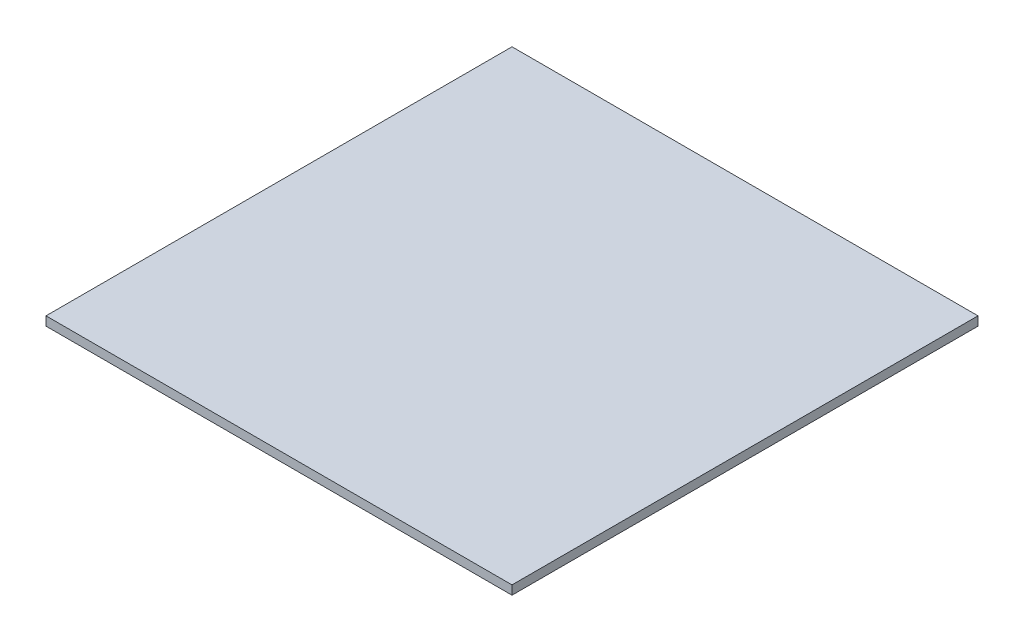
from build123d import *

# Parameters (mm, degrees)
SKETCH1_W           = 330.2
SKETCH1_H           = 330.2
BOSS_EXTRUDE1_DEPTH = 6.35


with BuildPart() as part:
    # Sketch1 → Boss-Extrude1 (new body)
    with BuildSketch(Plane(origin=(0, 0, 0), x_dir=(1, 0, 0), z_dir=(0, 1, 0))):
        Rectangle(SKETCH1_W, SKETCH1_H)
    extrude(amount=BOSS_EXTRUDE1_DEPTH)


solid = part.part
